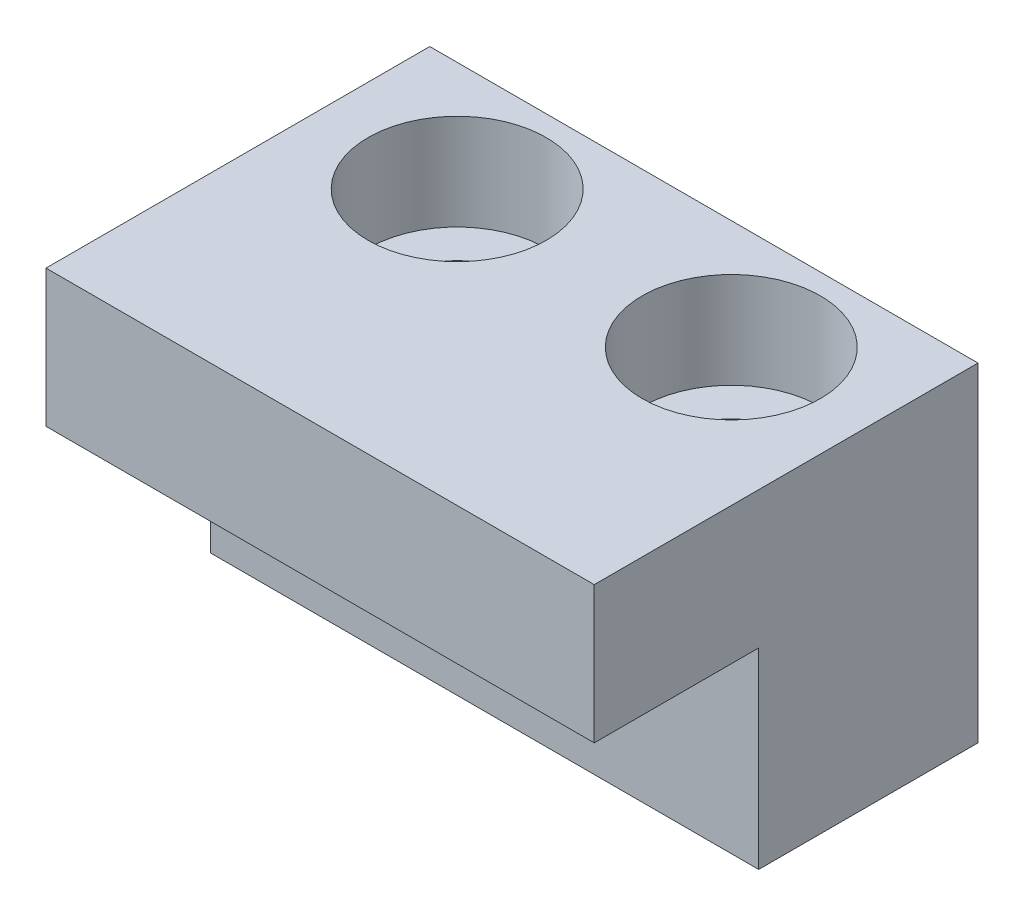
from build123d import *

# Parameters (mm, degrees)
SKETCH_1_W               = 20
SKETCH_1_H               = 12
EXTRUDE_1_DEPTH          = 14
CUT_EXTRUDE_1_DEPTH      = 28.202941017
CUT_EXTRUDE_1_DEPTH_BACK = 28.202941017
SKETCH_3_R               = 1.75
CUT_EXTRUDE_2_DEPTH      = 28.202941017
SKETCH_4_R               = 3.25
CUT_EXTRUDE_3_DEPTH      = 3.5
SKETCH_6_R               = 2
CUT_EXTRUDE_4_DEPTH      = 3.5


with BuildPart() as part:
    # Sketch 1 → Extrude 1 (new body)
    with BuildSketch(Plane.XY):
        with Locations((10, 6)):
            Rectangle(SKETCH_1_W, SKETCH_1_H)
    extrude(amount=EXTRUDE_1_DEPTH)

    # Sketch 2 → Cut-Extrude 1 (cut, two sides: drawn at the far end of the back side and taken through both)
    with BuildSketch(Plane(origin=(20, 0, 0), x_dir=(0, 0, -1), z_dir=(1, 0, 0)).offset(-CUT_EXTRUDE_1_DEPTH_BACK)):
        Polygon((-8, -41.304951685), (-8, 0), (-8, 7), (-14, 7), (-55.304951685, 7), (-114.326708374, -50.799899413), (-67.021756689, -99.104851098), align=None)
    extrude(amount=CUT_EXTRUDE_1_DEPTH + CUT_EXTRUDE_1_DEPTH_BACK, mode=Mode.SUBTRACT)

    # Sketch 3 → Cut-Extrude 2 (cut, through all)
    with BuildSketch(Plane(origin=(0, 12, 0), x_dir=(1, 0, 0), z_dir=(0, 1, 0))):
        with Locations(Location((5, -4, 0), (0, 0, 270))):
            Circle(SKETCH_3_R)
        with Locations(Location((15, -4, 0), (0, 0, 270))):
            Circle(SKETCH_3_R)
    extrude(amount=-CUT_EXTRUDE_2_DEPTH, mode=Mode.SUBTRACT)

    # Sketch 4 → Cut-Extrude 3 (cut)
    with BuildSketch(Plane(origin=(0, 12, 0), x_dir=(1, 0, 0), z_dir=(0, 1, 0))):
        with Locations(Location((5, -4, 0), (0, 0, 270))):
            Circle(SKETCH_4_R)
        with Locations(Location((15, -4, 0), (0, 0, 270))):
            Circle(SKETCH_4_R)
    extrude(amount=-CUT_EXTRUDE_3_DEPTH, mode=Mode.SUBTRACT)

    # Sketch 6 → Cut-Extrude 4 (cut)
    with BuildSketch(Plane.XZ.offset(-7)):
        with Locations(Location((5.5, 11, 0), (0, 0, 270))):
            Circle(SKETCH_6_R)
        with Locations(Location((14.5, 11, 0), (0, 0, 270))):
            Circle(SKETCH_6_R)
    extrude(amount=-CUT_EXTRUDE_4_DEPTH, mode=Mode.SUBTRACT)


solid = part.part
